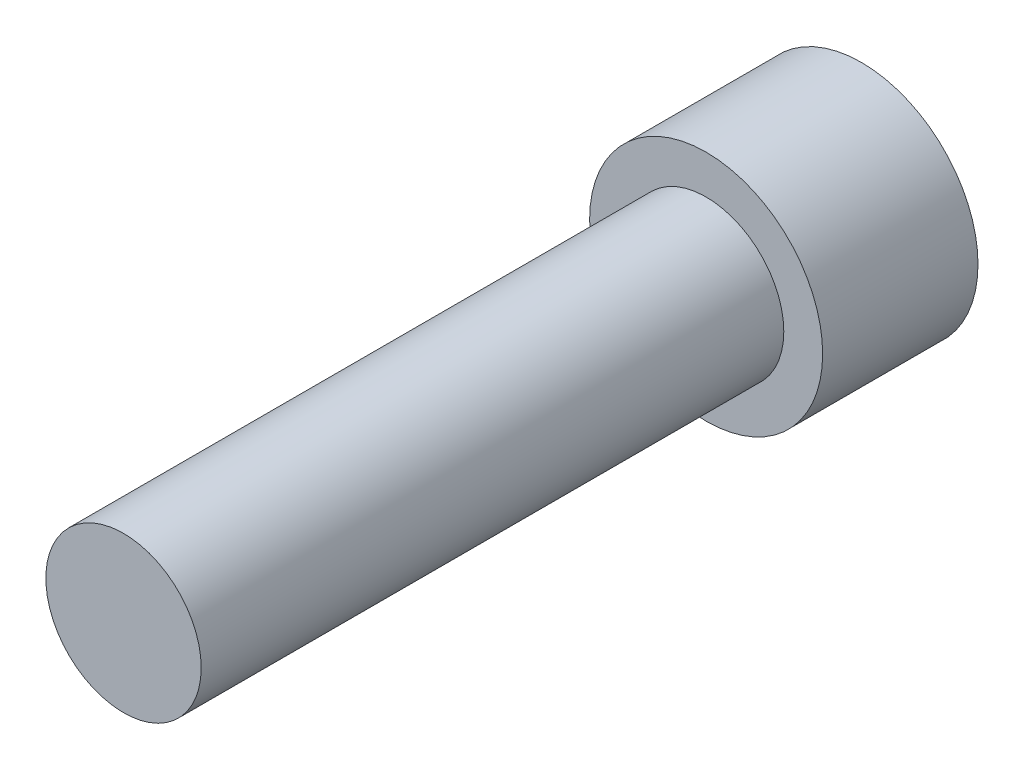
from build123d import *

# Parameters (mm, degrees)
HEX_2_DEPTH = 10


with BuildPart() as part:
    # Sketch6 → Revolve1 (revolve)
    with BuildSketch(Plane(origin=(0, 0, 0), x_dir=(0, 0, -1), z_dir=(1, 0, 0)), mode=Mode.PRIVATE) as revolve1_sk:
        Polygon((-45, 0), (-45, -6), (0, -6), (0, -9), (12, -9), (12, 0), align=None)
    revolve(revolve1_sk.sketch.rotate(Axis((0, 0, 45), (0, 0, -1)), 270), axis=Axis((0, 0, 45), (0, 0, -1)))

    # Sketch7 → HEX 2 (cut)
    with BuildSketch(Plane(origin=(0, 0, -12), x_dir=(-1, 0, 0), z_dir=(0, 0, -1))):
        Polygon((-5, 2.886751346), (-5, -2.886751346), (0, -5.773502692), (5, -2.886751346), (5, 2.886751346), (0, 5.773502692), align=None)
    extrude(amount=-HEX_2_DEPTH, mode=Mode.SUBTRACT)


solid = part.part
